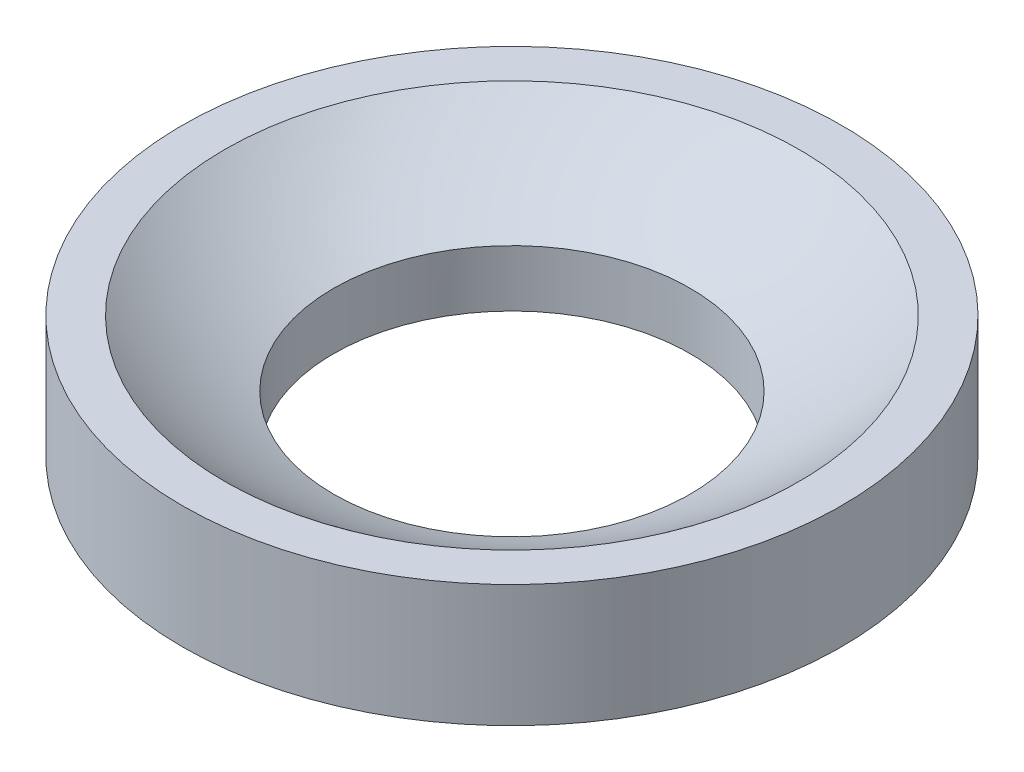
from build123d import *


with BuildPart() as part:
    # Esquisse2 → Base-R_volution (revolve)
    with BuildSketch(Plane.XY, mode=Mode.PRIVATE) as base_r_volution_sk:
        with BuildLine():
            Line((468.580237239, 261.218481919), (468.580237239, 263.238483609))
            ThreePointArc((468.580237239, 263.238483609), (466.553228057, 264.272151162), (464.690237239, 265.578481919))
            Line((464.690237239, 265.578481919), (463.186211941, 265.578481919))
            Line((463.186211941, 265.578481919), (463.186211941, 261.218481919))
            Line((463.186211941, 261.218481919), (468.580237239, 261.218481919))
        make_face()
    revolve(base_r_volution_sk.sketch.rotate(Axis((474.940237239, 265.578481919, 0), (0, -1, 0)), 270), axis=Axis((474.940237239, 265.578481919, 0), (0, -1, 0)))


solid = part.part
